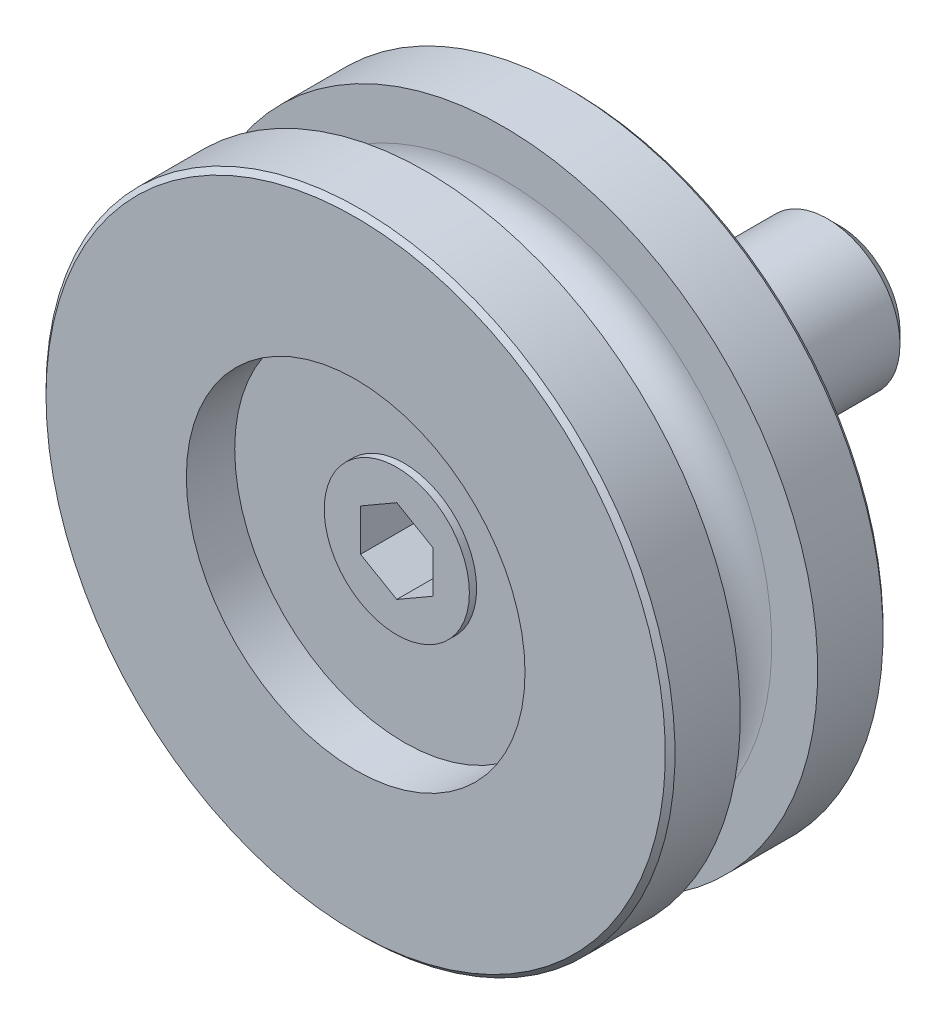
ISO-10303-21;
HEADER;
FILE_DESCRIPTION(('STEP AP214'),'2;1');
FILE_NAME('part.step','',(''),(''),'','','');
FILE_SCHEMA(('AUTOMOTIVE_DESIGN { 1 0 10303 214 1 1 1 1 }'));
ENDSEC;
DATA;
#1=APPLICATION_CONTEXT('core data for automotive mechanical design processes');
#2=APPLICATION_PROTOCOL_DEFINITION('international standard','automotive_design',2000,#1);
#3=PRODUCT_CONTEXT('',#1,'mechanical');
#4=PRODUCT('Part','Part','',(#3));
#5=PRODUCT_RELATED_PRODUCT_CATEGORY('part','',(#4));
#6=PRODUCT_DEFINITION_FORMATION('','',#4);
#7=PRODUCT_DEFINITION_CONTEXT('part definition',#1,'design');
#8=PRODUCT_DEFINITION('design','',#6,#7);
#9=PRODUCT_DEFINITION_SHAPE('','',#8);
#10=(LENGTH_UNIT() NAMED_UNIT(*) SI_UNIT(.MILLI.,.METRE.));
#11=(NAMED_UNIT(*) PLANE_ANGLE_UNIT() SI_UNIT($,.RADIAN.));
#12=(NAMED_UNIT(*) SI_UNIT($,.STERADIAN.) SOLID_ANGLE_UNIT());
#13=UNCERTAINTY_MEASURE_WITH_UNIT(LENGTH_MEASURE(1.E-05),#10,'distance_accuracy_value','');
#14=(GEOMETRIC_REPRESENTATION_CONTEXT(3) GLOBAL_UNCERTAINTY_ASSIGNED_CONTEXT((#13)) GLOBAL_UNIT_ASSIGNED_CONTEXT((#10,
#11,#12)) REPRESENTATION_CONTEXT('',''));
#15=CARTESIAN_POINT('',(0.,0.,0.));
#16=DIRECTION('',(0.,0.,1.));
#17=DIRECTION('',(1.,0.,0.));
#18=AXIS2_PLACEMENT_3D('',#15,#16,#17);
#19=CARTESIAN_POINT('',(0.,-0.5,3.));
#20=DIRECTION('',(0.,0.,1.));
#21=DIRECTION('',(-1.,0.,0.));
#22=AXIS2_PLACEMENT_3D('',#19,#20,#21);
#23=CYLINDRICAL_SURFACE('',#22,6.6);
#24=CARTESIAN_POINT('',(0.,-0.5,2.));
#25=DIRECTION('',(0.,0.,-1.));
#26=DIRECTION('',(0.,-1.,0.));
#27=AXIS2_PLACEMENT_3D('',#24,#25,#26);
#28=CIRCLE('',#27,6.6);
#29=CARTESIAN_POINT('',(-4.44128996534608,-5.38210440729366,2.));
#30=VERTEX_POINT('',#29);
#31=CARTESIAN_POINT('',(4.44128996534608,-5.38210440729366,2.));
#32=VERTEX_POINT('',#31);
#33=EDGE_CURVE('E193',#30,#32,#28,.T.);
#34=ORIENTED_EDGE('',*,*,#33,.T.);
#35=DIRECTION('',(0.,0.,-1.));
#36=VECTOR('',#35,1.);
#37=CARTESIAN_POINT('',(4.44128996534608,-5.38210440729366,3.));
#38=LINE('',#37,#36);
#39=CARTESIAN_POINT('',(4.44128996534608,-5.38210440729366,3.));
#40=VERTEX_POINT('',#39);
#41=EDGE_CURVE('E173',#40,#32,#38,.T.);
#42=ORIENTED_EDGE('',*,*,#41,.F.);
#43=CARTESIAN_POINT('',(0.,-0.5,3.));
#44=DIRECTION('',(0.,0.,-1.));
#45=DIRECTION('',(0.,-1.,0.));
#46=AXIS2_PLACEMENT_3D('',#43,#44,#45);
#47=CIRCLE('',#46,6.6);
#48=CARTESIAN_POINT('',(-4.44128996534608,-5.38210440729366,3.));
#49=VERTEX_POINT('',#48);
#50=EDGE_CURVE('E478',#49,#40,#47,.T.);
#51=ORIENTED_EDGE('',*,*,#50,.F.);
#52=DIRECTION('',(0.,0.,-1.));
#53=VECTOR('',#52,1.);
#54=CARTESIAN_POINT('',(-4.44128996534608,-5.38210440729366,3.));
#55=LINE('',#54,#53);
#56=EDGE_CURVE('E197',#49,#30,#55,.T.);
#57=ORIENTED_EDGE('',*,*,#56,.T.);
#58=EDGE_LOOP('',(#34,#42,#51,#57));
#59=FACE_BOUND('',#58,.T.);
#60=ADVANCED_FACE('F14',(#59),#23,.F.);
#61=CARTESIAN_POINT('',(2.87276702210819,-4.52608403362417,3.));
#62=DIRECTION('',(-0.479051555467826,-0.877786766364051,0.));
#63=DIRECTION('',(-0.877786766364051,0.479051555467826,0.));
#64=AXIS2_PLACEMENT_3D('',#61,#62,#63);
#65=PLANE('',#64);
#66=DIRECTION('',(-0.877786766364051,0.479051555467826,0.));
#67=VECTOR('',#66,1.);
#68=CARTESIAN_POINT('',(2.87276702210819,-4.52608403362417,2.));
#69=LINE('',#68,#67);
#70=CARTESIAN_POINT('',(2.87276702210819,-4.52608403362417,2.));
#71=VERTEX_POINT('',#70);
#72=EDGE_CURVE('E176',#32,#71,#69,.T.);
#73=ORIENTED_EDGE('',*,*,#72,.T.);
#74=DIRECTION('',(0.,0.,-1.));
#75=VECTOR('',#74,1.);
#76=CARTESIAN_POINT('',(2.87276702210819,-4.52608403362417,3.));
#77=LINE('',#76,#75);
#78=CARTESIAN_POINT('',(2.87276702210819,-4.52608403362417,3.));
#79=VERTEX_POINT('',#78);
#80=EDGE_CURVE('E187',#79,#71,#77,.T.);
#81=ORIENTED_EDGE('',*,*,#80,.F.);
#82=DIRECTION('',(-0.877786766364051,0.479051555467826,0.));
#83=VECTOR('',#82,1.);
#84=CARTESIAN_POINT('',(2.87276702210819,-4.52608403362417,3.));
#85=LINE('',#84,#83);
#86=EDGE_CURVE('E201',#40,#79,#85,.T.);
#87=ORIENTED_EDGE('',*,*,#86,.F.);
#88=ORIENTED_EDGE('',*,*,#41,.T.);
#89=EDGE_LOOP('',(#73,#81,#87,#88));
#90=FACE_BOUND('',#89,.T.);
#91=ADVANCED_FACE('F284',(#90),#65,.F.);
#92=CARTESIAN_POINT('',(-0.985268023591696,-5.96796092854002,3.));
#93=DIRECTION('',(-0.97287075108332,0.231349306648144,0.));
#94=DIRECTION('',(0.,0.,1.));
#95=AXIS2_PLACEMENT_3D('',#92,#93,#94);
#96=PLANE('',#95);
#97=DIRECTION('',(0.,0.,-1.));
#98=VECTOR('',#97,1.);
#99=CARTESIAN_POINT('',(-1.40277147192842,-7.72364759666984,-0.5));
#100=LINE('',#99,#98);
#101=CARTESIAN_POINT('',(-1.40277147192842,-7.72364759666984,2.));
#102=VERTEX_POINT('',#101);
#103=CARTESIAN_POINT('',(-1.40277147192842,-7.72364759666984,3.));
#104=VERTEX_POINT('',#103);
#105=EDGE_CURVE('E208',#102,#104,#100,.F.);
#106=ORIENTED_EDGE('',*,*,#105,.F.);
#107=DIRECTION('',(0.231349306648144,0.97287075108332,0.));
#108=VECTOR('',#107,1.);
#109=CARTESIAN_POINT('',(-0.985268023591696,-5.96796092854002,2.));
#110=LINE('',#109,#108);
#111=CARTESIAN_POINT('',(-0.985268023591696,-5.96796092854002,2.));
#112=VERTEX_POINT('',#111);
#113=EDGE_CURVE('E207',#102,#112,#110,.T.);
#114=ORIENTED_EDGE('',*,*,#113,.T.);
#115=DIRECTION('',(0.,0.,-1.));
#116=VECTOR('',#115,1.);
#117=CARTESIAN_POINT('',(-0.985268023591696,-5.96796092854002,3.));
#118=LINE('',#117,#116);
#119=CARTESIAN_POINT('',(-0.985268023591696,-5.96796092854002,3.));
#120=VERTEX_POINT('',#119);
#121=EDGE_CURVE('E167',#120,#112,#118,.T.);
#122=ORIENTED_EDGE('',*,*,#121,.F.);
#123=DIRECTION('',(0.231349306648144,0.97287075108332,0.));
#124=VECTOR('',#123,1.);
#125=CARTESIAN_POINT('',(-0.985268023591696,-5.96796092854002,3.));
#126=LINE('',#125,#124);
#127=EDGE_CURVE('E182',#104,#120,#126,.T.);
#128=ORIENTED_EDGE('',*,*,#127,.F.);
#129=EDGE_LOOP('',(#106,#114,#122,#128));
#130=FACE_BOUND('',#129,.T.);
#131=ADVANCED_FACE('F290',(#130),#96,.F.);
#132=CARTESIAN_POINT('',(-2.87276702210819,-4.52608403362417,3.));
#133=DIRECTION('',(0.479051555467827,-0.87778676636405,0.));
#134=DIRECTION('',(0.,0.,-1.));
#135=AXIS2_PLACEMENT_3D('',#132,#133,#134);
#136=PLANE('',#135);
#137=DIRECTION('',(-0.87778676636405,-0.479051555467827,0.));
#138=VECTOR('',#137,1.);
#139=CARTESIAN_POINT('',(-2.87276702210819,-4.52608403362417,2.));
#140=LINE('',#139,#138);
#141=CARTESIAN_POINT('',(-2.87276702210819,-4.52608403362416,2.));
#142=VERTEX_POINT('',#141);
#143=EDGE_CURVE('E211',#142,#30,#140,.T.);
#144=ORIENTED_EDGE('',*,*,#143,.T.);
#145=ORIENTED_EDGE('',*,*,#56,.F.);
#146=DIRECTION('',(-0.87778676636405,-0.479051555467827,0.));
#147=VECTOR('',#146,1.);
#148=CARTESIAN_POINT('',(-2.87276702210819,-4.52608403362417,3.));
#149=LINE('',#148,#147);
#150=CARTESIAN_POINT('',(-2.87276702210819,-4.52608403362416,3.));
#151=VERTEX_POINT('',#150);
#152=EDGE_CURVE('E177',#151,#49,#149,.T.);
#153=ORIENTED_EDGE('',*,*,#152,.F.);
#154=DIRECTION('',(0.,0.,-1.));
#155=VECTOR('',#154,1.);
#156=CARTESIAN_POINT('',(-2.87276702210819,-4.52608403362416,3.));
#157=LINE('',#156,#155);
#158=EDGE_CURVE('E192',#151,#142,#157,.T.);
#159=ORIENTED_EDGE('',*,*,#158,.T.);
#160=EDGE_LOOP('',(#144,#145,#153,#159));
#161=FACE_BOUND('',#160,.T.);
#162=ADVANCED_FACE('F300',(#161),#136,.F.);
#163=CARTESIAN_POINT('',(0.,-0.5,2.));
#164=DIRECTION('',(0.,0.,-1.));
#165=DIRECTION('',(0.,-1.,0.));
#166=AXIS2_PLACEMENT_3D('',#163,#164,#165);
#167=PLANE('',#166);
#168=CARTESIAN_POINT('',(-2.25,-5.66720682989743,2.));
#169=DIRECTION('',(0.,0.,-1.));
#170=DIRECTION('',(1.,0.,0.));
#171=AXIS2_PLACEMENT_3D('',#168,#169,#170);
#172=CIRCLE('',#171,0.85);
#173=CARTESIAN_POINT('',(-1.4,-5.66720682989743,2.));
#174=VERTEX_POINT('',#173);
#175=EDGE_CURVE('E157',#174,#174,#172,.T.);
#176=ORIENTED_EDGE('',*,*,#175,.F.);
#177=EDGE_LOOP('',(#176));
#178=FACE_BOUND('',#177,.T.);
#179=CARTESIAN_POINT('',(2.25,-5.66720682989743,2.));
#180=DIRECTION('',(0.,0.,1.));
#181=DIRECTION('',(1.,0.,0.));
#182=AXIS2_PLACEMENT_3D('',#179,#180,#181);
#183=CIRCLE('',#182,0.85);
#184=CARTESIAN_POINT('',(3.1,-5.66720682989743,2.));
#185=VERTEX_POINT('',#184);
#186=EDGE_CURVE('E188',#185,#185,#183,.T.);
#187=ORIENTED_EDGE('',*,*,#186,.T.);
#188=EDGE_LOOP('',(#187));
#189=FACE_BOUND('',#188,.T.);
#190=ORIENTED_EDGE('',*,*,#113,.F.);
#191=CARTESIAN_POINT('',(0.,0.,2.));
#192=DIRECTION('',(0.,0.,-1.));
#193=DIRECTION('',(-1.,0.,0.));
#194=AXIS2_PLACEMENT_3D('',#191,#192,#193);
#195=CIRCLE('',#194,7.85);
#196=CARTESIAN_POINT('',(1.40277147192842,-7.72364759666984,2.));
#197=VERTEX_POINT('',#196);
#198=EDGE_CURVE('E9',#102,#197,#195,.T.);
#199=ORIENTED_EDGE('',*,*,#198,.T.);
#200=DIRECTION('',(0.231349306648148,-0.972870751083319,0.));
#201=VECTOR('',#200,1.);
#202=CARTESIAN_POINT('',(0.985268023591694,-5.96796092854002,2.));
#203=LINE('',#202,#201);
#204=CARTESIAN_POINT('',(0.985268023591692,-5.96796092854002,2.));
#205=VERTEX_POINT('',#204);
#206=EDGE_CURVE('E206',#205,#197,#203,.T.);
#207=ORIENTED_EDGE('',*,*,#206,.F.);
#208=CARTESIAN_POINT('',(2.25,-5.66720682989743,2.));
#209=DIRECTION('',(0.,0.,1.));
#210=DIRECTION('',(1.,0.,0.));
#211=AXIS2_PLACEMENT_3D('',#208,#209,#210);
#212=CIRCLE('',#211,1.3);
#213=EDGE_CURVE('E183',#71,#205,#212,.T.);
#214=ORIENTED_EDGE('',*,*,#213,.F.);
#215=ORIENTED_EDGE('',*,*,#72,.F.);
#216=ORIENTED_EDGE('',*,*,#33,.F.);
#217=ORIENTED_EDGE('',*,*,#143,.F.);
#218=CARTESIAN_POINT('',(-2.25,-5.66720682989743,2.));
#219=DIRECTION('',(0.,0.,1.));
#220=DIRECTION('',(-1.,0.,0.));
#221=AXIS2_PLACEMENT_3D('',#218,#219,#220);
#222=CIRCLE('',#221,1.3);
#223=EDGE_CURVE('E465',#112,#142,#222,.T.);
#224=ORIENTED_EDGE('',*,*,#223,.F.);
#225=EDGE_LOOP('',(#190,#199,#207,#214,#215,#216,#217,#224));
#226=FACE_BOUND('',#225,.T.);
#227=ADVANCED_FACE('F303',(#178,#189,#226),#167,.T.);
#228=CARTESIAN_POINT('',(2.25,-5.66720682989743,3.));
#229=DIRECTION('',(0.,0.,1.));
#230=DIRECTION('',(-1.,0.,0.));
#231=AXIS2_PLACEMENT_3D('',#228,#229,#230);
#232=CYLINDRICAL_SURFACE('',#231,0.85);
#233=ORIENTED_EDGE('',*,*,#186,.F.);
#234=EDGE_LOOP('',(#233));
#235=FACE_BOUND('',#234,.T.);
#236=CARTESIAN_POINT('',(2.25,-5.66720682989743,3.));
#237=DIRECTION('',(0.,0.,1.));
#238=DIRECTION('',(1.,0.,0.));
#239=AXIS2_PLACEMENT_3D('',#236,#237,#238);
#240=CIRCLE('',#239,0.85);
#241=CARTESIAN_POINT('',(3.1,-5.66720682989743,3.));
#242=VERTEX_POINT('',#241);
#243=EDGE_CURVE('E152',#242,#242,#240,.T.);
#244=ORIENTED_EDGE('',*,*,#243,.T.);
#245=EDGE_LOOP('',(#244));
#246=FACE_BOUND('',#245,.T.);
#247=ADVANCED_FACE('F307',(#235,#246),#232,.F.);
#248=CARTESIAN_POINT('',(-2.25,-5.66720682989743,3.));
#249=DIRECTION('',(0.,0.,1.));
#250=DIRECTION('',(-1.,0.,0.));
#251=AXIS2_PLACEMENT_3D('',#248,#249,#250);
#252=CYLINDRICAL_SURFACE('',#251,0.85);
#253=ORIENTED_EDGE('',*,*,#175,.T.);
#254=EDGE_LOOP('',(#253));
#255=FACE_BOUND('',#254,.T.);
#256=CARTESIAN_POINT('',(-2.25,-5.66720682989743,3.));
#257=DIRECTION('',(0.,0.,-1.));
#258=DIRECTION('',(1.,0.,0.));
#259=AXIS2_PLACEMENT_3D('',#256,#257,#258);
#260=CIRCLE('',#259,0.85);
#261=CARTESIAN_POINT('',(-1.4,-5.66720682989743,3.));
#262=VERTEX_POINT('',#261);
#263=EDGE_CURVE('E171',#262,#262,#260,.T.);
#264=ORIENTED_EDGE('',*,*,#263,.F.);
#265=EDGE_LOOP('',(#264));
#266=FACE_BOUND('',#265,.T.);
#267=ADVANCED_FACE('F312',(#255,#266),#252,.F.);
#268=CARTESIAN_POINT('',(-2.25,-5.66720682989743,3.));
#269=DIRECTION('',(0.,0.,1.));
#270=DIRECTION('',(-1.,0.,0.));
#271=AXIS2_PLACEMENT_3D('',#268,#269,#270);
#272=CYLINDRICAL_SURFACE('',#271,1.3);
#273=ORIENTED_EDGE('',*,*,#223,.T.);
#274=ORIENTED_EDGE('',*,*,#158,.F.);
#275=CARTESIAN_POINT('',(-2.25,-5.66720682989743,3.));
#276=DIRECTION('',(0.,0.,1.));
#277=DIRECTION('',(-1.,0.,0.));
#278=AXIS2_PLACEMENT_3D('',#275,#276,#277);
#279=CIRCLE('',#278,1.3);
#280=EDGE_CURVE('E178',#120,#151,#279,.T.);
#281=ORIENTED_EDGE('',*,*,#280,.F.);
#282=ORIENTED_EDGE('',*,*,#121,.T.);
#283=EDGE_LOOP('',(#273,#274,#281,#282));
#284=FACE_BOUND('',#283,.T.);
#285=ADVANCED_FACE('F298',(#284),#272,.T.);
#286=CARTESIAN_POINT('',(2.25,-5.66720682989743,3.));
#287=DIRECTION('',(0.,0.,1.));
#288=DIRECTION('',(-1.,0.,0.));
#289=AXIS2_PLACEMENT_3D('',#286,#287,#288);
#290=CYLINDRICAL_SURFACE('',#289,1.3);
#291=ORIENTED_EDGE('',*,*,#213,.T.);
#292=DIRECTION('',(0.,0.,-1.));
#293=VECTOR('',#292,1.);
#294=CARTESIAN_POINT('',(0.985268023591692,-5.96796092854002,3.));
#295=LINE('',#294,#293);
#296=CARTESIAN_POINT('',(0.985268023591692,-5.96796092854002,3.));
#297=VERTEX_POINT('',#296);
#298=EDGE_CURVE('E202',#297,#205,#295,.T.);
#299=ORIENTED_EDGE('',*,*,#298,.F.);
#300=CARTESIAN_POINT('',(2.25,-5.66720682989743,3.));
#301=DIRECTION('',(0.,0.,1.));
#302=DIRECTION('',(1.,0.,0.));
#303=AXIS2_PLACEMENT_3D('',#300,#301,#302);
#304=CIRCLE('',#303,1.3);
#305=EDGE_CURVE('E198',#79,#297,#304,.T.);
#306=ORIENTED_EDGE('',*,*,#305,.F.);
#307=ORIENTED_EDGE('',*,*,#80,.T.);
#308=EDGE_LOOP('',(#291,#299,#306,#307));
#309=FACE_BOUND('',#308,.T.);
#310=ADVANCED_FACE('F294',(#309),#290,.T.);
#311=CARTESIAN_POINT('',(0.985268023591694,-5.96796092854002,3.));
#312=DIRECTION('',(0.972870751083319,0.231349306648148,0.));
#313=DIRECTION('',(0.,0.,-1.));
#314=AXIS2_PLACEMENT_3D('',#311,#312,#313);
#315=PLANE('',#314);
#316=DIRECTION('',(0.,0.,-1.));
#317=VECTOR('',#316,1.);
#318=CARTESIAN_POINT('',(1.40277147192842,-7.72364759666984,-0.5));
#319=LINE('',#318,#317);
#320=CARTESIAN_POINT('',(1.40277147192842,-7.72364759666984,3.));
#321=VERTEX_POINT('',#320);
#322=EDGE_CURVE('E18',#321,#197,#319,.T.);
#323=ORIENTED_EDGE('',*,*,#322,.F.);
#324=DIRECTION('',(0.231349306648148,-0.972870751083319,0.));
#325=VECTOR('',#324,1.);
#326=CARTESIAN_POINT('',(0.985268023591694,-5.96796092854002,3.));
#327=LINE('',#326,#325);
#328=EDGE_CURVE('E31',#297,#321,#327,.T.);
#329=ORIENTED_EDGE('',*,*,#328,.F.);
#330=ORIENTED_EDGE('',*,*,#298,.T.);
#331=ORIENTED_EDGE('',*,*,#206,.T.);
#332=EDGE_LOOP('',(#323,#329,#330,#331));
#333=FACE_BOUND('',#332,.T.);
#334=ADVANCED_FACE('F297',(#333),#315,.F.);
#335=CARTESIAN_POINT('',(0.,4.,3.));
#336=DIRECTION('',(0.,0.,1.));
#337=DIRECTION('',(1.,0.,0.));
#338=AXIS2_PLACEMENT_3D('',#335,#336,#337);
#339=PLANE('',#338);
#340=ORIENTED_EDGE('',*,*,#243,.F.);
#341=EDGE_LOOP('',(#340));
#342=FACE_BOUND('',#341,.T.);
#343=ADVANCED_FACE('F324',(#342),#339,.F.);
#344=ORIENTED_EDGE('',*,*,#263,.T.);
#345=EDGE_LOOP('',(#344));
#346=FACE_BOUND('',#345,.T.);
#347=ADVANCED_FACE('F390',(#346),#339,.F.);
#348=CARTESIAN_POINT('',(0.,0.,5.8));
#349=DIRECTION('',(0.,0.,1.));
#350=DIRECTION('',(1.,0.,0.));
#351=AXIS2_PLACEMENT_3D('',#348,#349,#350);
#352=PLANE('',#351);
#353=DIRECTION('',(-0.866025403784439,0.5,0.));
#354=VECTOR('',#353,1.);
#355=CARTESIAN_POINT('',(1.5,0.86602540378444,5.8));
#356=LINE('',#355,#354);
#357=CARTESIAN_POINT('',(1.5,0.86602540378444,5.8));
#358=VERTEX_POINT('',#357);
#359=CARTESIAN_POINT('',(0.,1.73205080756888,5.8));
#360=VERTEX_POINT('',#359);
#361=EDGE_CURVE('E79',#358,#360,#356,.T.);
#362=ORIENTED_EDGE('',*,*,#361,.T.);
#363=DIRECTION('',(-0.866025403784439,-0.5,0.));
#364=VECTOR('',#363,1.);
#365=CARTESIAN_POINT('',(0.,1.73205080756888,5.8));
#366=LINE('',#365,#364);
#367=CARTESIAN_POINT('',(-1.5,0.866025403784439,5.8));
#368=VERTEX_POINT('',#367);
#369=EDGE_CURVE('E249',#360,#368,#366,.T.);
#370=ORIENTED_EDGE('',*,*,#369,.T.);
#371=DIRECTION('',(0.,-1.,0.));
#372=VECTOR('',#371,1.);
#373=CARTESIAN_POINT('',(-1.5,0.866025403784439,5.8));
#374=LINE('',#373,#372);
#375=CARTESIAN_POINT('',(-1.5,-0.866025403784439,5.8));
#376=VERTEX_POINT('',#375);
#377=EDGE_CURVE('E252',#368,#376,#374,.T.);
#378=ORIENTED_EDGE('',*,*,#377,.T.);
#379=DIRECTION('',(0.866025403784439,-0.5,0.));
#380=VECTOR('',#379,1.);
#381=CARTESIAN_POINT('',(-1.5,-0.866025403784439,5.8));
#382=LINE('',#381,#380);
#383=CARTESIAN_POINT('',(0.,-1.73205080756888,5.8));
#384=VERTEX_POINT('',#383);
#385=EDGE_CURVE('E255',#376,#384,#382,.T.);
#386=ORIENTED_EDGE('',*,*,#385,.T.);
#387=DIRECTION('',(0.866025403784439,0.5,0.));
#388=VECTOR('',#387,1.);
#389=CARTESIAN_POINT('',(0.,-1.73205080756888,5.8));
#390=LINE('',#389,#388);
#391=CARTESIAN_POINT('',(1.5,-0.866025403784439,5.8));
#392=VERTEX_POINT('',#391);
#393=EDGE_CURVE('E257',#384,#392,#390,.T.);
#394=ORIENTED_EDGE('',*,*,#393,.T.);
#395=DIRECTION('',(0.,1.,0.));
#396=VECTOR('',#395,1.);
#397=CARTESIAN_POINT('',(1.5,-0.866025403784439,5.8));
#398=LINE('',#397,#396);
#399=EDGE_CURVE('E108',#392,#358,#398,.T.);
#400=ORIENTED_EDGE('',*,*,#399,.T.);
#401=EDGE_LOOP('',(#362,#370,#378,#386,#394,#400));
#402=FACE_BOUND('',#401,.T.);
#403=ADVANCED_FACE('F261',(#402),#352,.T.);
#404=CARTESIAN_POINT('',(-1.5,0.866025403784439,5.8));
#405=DIRECTION('',(-1.,0.,0.));
#406=DIRECTION('',(0.,-1.,0.));
#407=AXIS2_PLACEMENT_3D('',#404,#405,#406);
#408=PLANE('',#407);
#409=DIRECTION('',(0.,-1.,0.));
#410=VECTOR('',#409,1.);
#411=CARTESIAN_POINT('',(-1.5,0.866025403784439,8.3));
#412=LINE('',#411,#410);
#413=CARTESIAN_POINT('',(-1.5,0.866025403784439,8.3));
#414=VERTEX_POINT('',#413);
#415=CARTESIAN_POINT('',(-1.5,-0.866025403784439,8.3));
#416=VERTEX_POINT('',#415);
#417=EDGE_CURVE('E102',#414,#416,#412,.T.);
#418=ORIENTED_EDGE('',*,*,#417,.T.);
#419=DIRECTION('',(0.,0.,1.));
#420=VECTOR('',#419,1.);
#421=CARTESIAN_POINT('',(-1.5,-0.866025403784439,5.8));
#422=LINE('',#421,#420);
#423=EDGE_CURVE('E120',#376,#416,#422,.T.);
#424=ORIENTED_EDGE('',*,*,#423,.F.);
#425=ORIENTED_EDGE('',*,*,#377,.F.);
#426=DIRECTION('',(0.,0.,1.));
#427=VECTOR('',#426,1.);
#428=CARTESIAN_POINT('',(-1.5,0.866025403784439,5.8));
#429=LINE('',#428,#427);
#430=EDGE_CURVE('E122',#368,#414,#429,.T.);
#431=ORIENTED_EDGE('',*,*,#430,.T.);
#432=EDGE_LOOP('',(#418,#424,#425,#431));
#433=FACE_BOUND('',#432,.T.);
#434=ADVANCED_FACE('F267',(#433),#408,.F.);
#435=CARTESIAN_POINT('',(-1.5,-0.866025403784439,5.8));
#436=DIRECTION('',(-0.5,-0.866025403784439,0.));
#437=DIRECTION('',(0.866025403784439,-0.5,0.));
#438=AXIS2_PLACEMENT_3D('',#435,#436,#437);
#439=PLANE('',#438);
#440=DIRECTION('',(0.866025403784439,-0.5,0.));
#441=VECTOR('',#440,1.);
#442=CARTESIAN_POINT('',(-1.5,-0.866025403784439,8.3));
#443=LINE('',#442,#441);
#444=CARTESIAN_POINT('',(0.,-1.73205080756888,8.3));
#445=VERTEX_POINT('',#444);
#446=EDGE_CURVE('E113',#416,#445,#443,.T.);
#447=ORIENTED_EDGE('',*,*,#446,.T.);
#448=DIRECTION('',(0.,0.,1.));
#449=VECTOR('',#448,1.);
#450=CARTESIAN_POINT('',(0.,-1.73205080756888,5.8));
#451=LINE('',#450,#449);
#452=EDGE_CURVE('E118',#384,#445,#451,.T.);
#453=ORIENTED_EDGE('',*,*,#452,.F.);
#454=ORIENTED_EDGE('',*,*,#385,.F.);
#455=ORIENTED_EDGE('',*,*,#423,.T.);
#456=EDGE_LOOP('',(#447,#453,#454,#455));
#457=FACE_BOUND('',#456,.T.);
#458=ADVANCED_FACE('F271',(#457),#439,.F.);
#459=CARTESIAN_POINT('',(0.,-1.73205080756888,5.8));
#460=DIRECTION('',(0.5,-0.866025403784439,0.));
#461=DIRECTION('',(0.866025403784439,0.5,0.));
#462=AXIS2_PLACEMENT_3D('',#459,#460,#461);
#463=PLANE('',#462);
#464=DIRECTION('',(0.866025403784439,0.5,0.));
#465=VECTOR('',#464,1.);
#466=CARTESIAN_POINT('',(0.,-1.73205080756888,8.3));
#467=LINE('',#466,#465);
#468=CARTESIAN_POINT('',(1.5,-0.866025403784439,8.3));
#469=VERTEX_POINT('',#468);
#470=EDGE_CURVE('E92',#445,#469,#467,.T.);
#471=ORIENTED_EDGE('',*,*,#470,.T.);
#472=DIRECTION('',(0.,0.,1.));
#473=VECTOR('',#472,1.);
#474=CARTESIAN_POINT('',(1.5,-0.866025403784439,5.8));
#475=LINE('',#474,#473);
#476=EDGE_CURVE('E84',#392,#469,#475,.T.);
#477=ORIENTED_EDGE('',*,*,#476,.F.);
#478=ORIENTED_EDGE('',*,*,#393,.F.);
#479=ORIENTED_EDGE('',*,*,#452,.T.);
#480=EDGE_LOOP('',(#471,#477,#478,#479));
#481=FACE_BOUND('',#480,.T.);
#482=ADVANCED_FACE('F273',(#481),#463,.F.);
#483=CARTESIAN_POINT('',(1.5,-0.866025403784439,5.8));
#484=DIRECTION('',(1.,0.,0.));
#485=DIRECTION('',(0.,1.,0.));
#486=AXIS2_PLACEMENT_3D('',#483,#484,#485);
#487=PLANE('',#486);
#488=DIRECTION('',(0.,1.,0.));
#489=VECTOR('',#488,1.);
#490=CARTESIAN_POINT('',(1.5,-0.866025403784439,8.3));
#491=LINE('',#490,#489);
#492=CARTESIAN_POINT('',(1.5,0.86602540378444,8.3));
#493=VERTEX_POINT('',#492);
#494=EDGE_CURVE('E87',#469,#493,#491,.T.);
#495=ORIENTED_EDGE('',*,*,#494,.T.);
#496=DIRECTION('',(0.,0.,1.));
#497=VECTOR('',#496,1.);
#498=CARTESIAN_POINT('',(1.5,0.86602540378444,5.8));
#499=LINE('',#498,#497);
#500=EDGE_CURVE('E72',#358,#493,#499,.T.);
#501=ORIENTED_EDGE('',*,*,#500,.F.);
#502=ORIENTED_EDGE('',*,*,#399,.F.);
#503=ORIENTED_EDGE('',*,*,#476,.T.);
#504=EDGE_LOOP('',(#495,#501,#502,#503));
#505=FACE_BOUND('',#504,.T.);
#506=ADVANCED_FACE('F88',(#505),#487,.F.);
#507=CARTESIAN_POINT('',(1.5,0.86602540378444,5.8));
#508=DIRECTION('',(0.5,0.866025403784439,0.));
#509=DIRECTION('',(-0.866025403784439,0.5,0.));
#510=AXIS2_PLACEMENT_3D('',#507,#508,#509);
#511=PLANE('',#510);
#512=DIRECTION('',(-0.866025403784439,0.5,0.));
#513=VECTOR('',#512,1.);
#514=CARTESIAN_POINT('',(1.5,0.86602540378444,8.3));
#515=LINE('',#514,#513);
#516=CARTESIAN_POINT('',(0.,1.73205080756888,8.3));
#517=VERTEX_POINT('',#516);
#518=EDGE_CURVE('E76',#493,#517,#515,.T.);
#519=ORIENTED_EDGE('',*,*,#518,.T.);
#520=DIRECTION('',(0.,0.,1.));
#521=VECTOR('',#520,1.);
#522=CARTESIAN_POINT('',(0.,1.73205080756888,5.8));
#523=LINE('',#522,#521);
#524=EDGE_CURVE('E124',#360,#517,#523,.T.);
#525=ORIENTED_EDGE('',*,*,#524,.F.);
#526=ORIENTED_EDGE('',*,*,#361,.F.);
#527=ORIENTED_EDGE('',*,*,#500,.T.);
#528=EDGE_LOOP('',(#519,#525,#526,#527));
#529=FACE_BOUND('',#528,.T.);
#530=ADVANCED_FACE('F74',(#529),#511,.F.);
#531=CARTESIAN_POINT('',(0.,1.73205080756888,5.8));
#532=DIRECTION('',(-0.5,0.866025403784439,0.));
#533=DIRECTION('',(-0.866025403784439,-0.5,0.));
#534=AXIS2_PLACEMENT_3D('',#531,#532,#533);
#535=PLANE('',#534);
#536=DIRECTION('',(-0.866025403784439,-0.5,0.));
#537=VECTOR('',#536,1.);
#538=CARTESIAN_POINT('',(0.,1.73205080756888,8.3));
#539=LINE('',#538,#537);
#540=EDGE_CURVE('E99',#517,#414,#539,.T.);
#541=ORIENTED_EDGE('',*,*,#540,.T.);
#542=ORIENTED_EDGE('',*,*,#430,.F.);
#543=ORIENTED_EDGE('',*,*,#369,.F.);
#544=ORIENTED_EDGE('',*,*,#524,.T.);
#545=EDGE_LOOP('',(#541,#542,#543,#544));
#546=FACE_BOUND('',#545,.T.);
#547=ADVANCED_FACE('F265',(#546),#535,.F.);
#548=CARTESIAN_POINT('',(0.,3.,8.3));
#549=DIRECTION('',(0.,0.,-1.));
#550=DIRECTION('',(-1.,0.,0.));
#551=AXIS2_PLACEMENT_3D('',#548,#549,#550);
#552=PLANE('',#551);
#553=ORIENTED_EDGE('',*,*,#540,.F.);
#554=ORIENTED_EDGE('',*,*,#518,.F.);
#555=ORIENTED_EDGE('',*,*,#494,.F.);
#556=ORIENTED_EDGE('',*,*,#470,.F.);
#557=ORIENTED_EDGE('',*,*,#446,.F.);
#558=ORIENTED_EDGE('',*,*,#417,.F.);
#559=EDGE_LOOP('',(#553,#554,#555,#556,#557,#558));
#560=FACE_BOUND('',#559,.T.);
#561=CARTESIAN_POINT('',(0.,0.,8.3));
#562=DIRECTION('',(0.,0.,1.));
#563=DIRECTION('',(1.,0.,0.));
#564=AXIS2_PLACEMENT_3D('',#561,#562,#563);
#565=CIRCLE('',#564,3.);
#566=CARTESIAN_POINT('',(3.,0.,8.3));
#567=VERTEX_POINT('',#566);
#568=EDGE_CURVE('E83',#567,#567,#565,.T.);
#569=ORIENTED_EDGE('',*,*,#568,.T.);
#570=EDGE_LOOP('',(#569));
#571=FACE_BOUND('',#570,.T.);
#572=ADVANCED_FACE('F95',(#560,#571),#552,.F.);
#573=CARTESIAN_POINT('',(0.,0.,11.5));
#574=DIRECTION('',(0.,0.,1.));
#575=DIRECTION('',(1.,0.,0.));
#576=AXIS2_PLACEMENT_3D('',#573,#574,#575);
#577=CYLINDRICAL_SURFACE('',#576,3.);
#578=ORIENTED_EDGE('',*,*,#568,.F.);
#579=EDGE_LOOP('',(#578));
#580=FACE_BOUND('',#579,.T.);
#581=CARTESIAN_POINT('',(0.,0.,8.));
#582=DIRECTION('',(0.,0.,1.));
#583=DIRECTION('',(1.,0.,0.));
#584=AXIS2_PLACEMENT_3D('',#581,#582,#583);
#585=CIRCLE('',#584,3.);
#586=CARTESIAN_POINT('',(3.,0.,8.));
#587=VERTEX_POINT('',#586);
#588=EDGE_CURVE('E128',#587,#587,#585,.T.);
#589=ORIENTED_EDGE('',*,*,#588,.T.);
#590=EDGE_LOOP('',(#589));
#591=FACE_BOUND('',#590,.T.);
#592=ADVANCED_FACE('F636',(#580,#591),#577,.T.);
#593=CARTESIAN_POINT('',(0.,3.,8.));
#594=DIRECTION('',(0.,0.,-1.));
#595=DIRECTION('',(-1.,0.,0.));
#596=AXIS2_PLACEMENT_3D('',#593,#594,#595);
#597=PLANE('',#596);
#598=ORIENTED_EDGE('',*,*,#588,.F.);
#599=EDGE_LOOP('',(#598));
#600=FACE_BOUND('',#599,.T.);
#601=CARTESIAN_POINT('',(0.,0.,8.));
#602=DIRECTION('',(0.,0.,1.));
#603=DIRECTION('',(1.,0.,0.));
#604=AXIS2_PLACEMENT_3D('',#601,#602,#603);
#605=CIRCLE('',#604,7.);
#606=CARTESIAN_POINT('',(7.,0.,8.));
#607=VERTEX_POINT('',#606);
#608=EDGE_CURVE('E131',#607,#607,#605,.T.);
#609=ORIENTED_EDGE('',*,*,#608,.T.);
#610=EDGE_LOOP('',(#609));
#611=FACE_BOUND('',#610,.T.);
#612=ADVANCED_FACE('F645',(#600,#611),#597,.F.);
#613=CARTESIAN_POINT('',(0.,0.,11.5));
#614=DIRECTION('',(0.,0.,1.));
#615=DIRECTION('',(1.,0.,0.));
#616=AXIS2_PLACEMENT_3D('',#613,#614,#615);
#617=CYLINDRICAL_SURFACE('',#616,7.);
#618=ORIENTED_EDGE('',*,*,#608,.F.);
#619=EDGE_LOOP('',(#618));
#620=FACE_BOUND('',#619,.T.);
#621=CARTESIAN_POINT('',(0.,0.,10.));
#622=DIRECTION('',(0.,0.,-1.));
#623=DIRECTION('',(-1.,0.,0.));
#624=AXIS2_PLACEMENT_3D('',#621,#622,#623);
#625=CIRCLE('',#624,7.);
#626=CARTESIAN_POINT('',(-7.,0.,10.));
#627=VERTEX_POINT('',#626);
#628=EDGE_CURVE('E100',#627,#627,#625,.T.);
#629=ORIENTED_EDGE('',*,*,#628,.F.);
#630=EDGE_LOOP('',(#629));
#631=FACE_BOUND('',#630,.T.);
#632=ADVANCED_FACE('F387',(#620,#631),#617,.F.);
#633=CARTESIAN_POINT('',(0.,7.,10.));
#634=DIRECTION('',(0.,0.,1.));
#635=DIRECTION('',(1.,0.,0.));
#636=AXIS2_PLACEMENT_3D('',#633,#634,#635);
#637=PLANE('',#636);
#638=ORIENTED_EDGE('',*,*,#628,.T.);
#639=EDGE_LOOP('',(#638));
#640=FACE_BOUND('',#639,.T.);
#641=CARTESIAN_POINT('',(0.,0.,10.));
#642=DIRECTION('',(0.,0.,-1.));
#643=DIRECTION('',(-1.,0.,0.));
#644=AXIS2_PLACEMENT_3D('',#641,#642,#643);
#645=CIRCLE('',#644,12.8);
#646=CARTESIAN_POINT('',(-12.8,0.,10.));
#647=VERTEX_POINT('',#646);
#648=EDGE_CURVE('E141',#647,#647,#645,.T.);
#649=ORIENTED_EDGE('',*,*,#648,.F.);
#650=EDGE_LOOP('',(#649));
#651=FACE_BOUND('',#650,.T.);
#652=ADVANCED_FACE('F359',(#640,#651),#637,.T.);
#653=CARTESIAN_POINT('',(0.,0.,9.8));
#654=DIRECTION('',(0.,0.,-1.));
#655=DIRECTION('',(-1.,0.,0.));
#656=AXIS2_PLACEMENT_3D('',#653,#654,#655);
#657=CONICAL_SURFACE('',#656,13.,0.785398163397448);
#658=ORIENTED_EDGE('',*,*,#648,.T.);
#659=EDGE_LOOP('',(#658));
#660=FACE_BOUND('',#659,.T.);
#661=CARTESIAN_POINT('',(0.,0.,9.8));
#662=DIRECTION('',(0.,0.,-1.));
#663=DIRECTION('',(-1.,0.,0.));
#664=AXIS2_PLACEMENT_3D('',#661,#662,#663);
#665=CIRCLE('',#664,13.);
#666=CARTESIAN_POINT('',(-13.,0.,9.8));
#667=VERTEX_POINT('',#666);
#668=EDGE_CURVE('E228',#667,#667,#665,.T.);
#669=ORIENTED_EDGE('',*,*,#668,.F.);
#670=EDGE_LOOP('',(#669));
#671=FACE_BOUND('',#670,.T.);
#672=ADVANCED_FACE('F355',(#660,#671),#657,.T.);
#673=CARTESIAN_POINT('',(0.,0.,2.5));
#674=DIRECTION('',(0.,0.,-1.));
#675=DIRECTION('',(-1.,0.,0.));
#676=AXIS2_PLACEMENT_3D('',#673,#674,#675);
#677=CYLINDRICAL_SURFACE('',#676,13.);
#678=ORIENTED_EDGE('',*,*,#668,.T.);
#679=EDGE_LOOP('',(#678));
#680=FACE_BOUND('',#679,.T.);
#681=CARTESIAN_POINT('',(0.,0.,7.1));
#682=DIRECTION('',(0.,0.,-1.));
#683=DIRECTION('',(-1.,0.,0.));
#684=AXIS2_PLACEMENT_3D('',#681,#682,#683);
#685=CIRCLE('',#684,13.);
#686=CARTESIAN_POINT('',(-13.,0.,7.1));
#687=VERTEX_POINT('',#686);
#688=EDGE_CURVE('E231',#687,#687,#685,.T.);
#689=ORIENTED_EDGE('',*,*,#688,.F.);
#690=EDGE_LOOP('',(#689));
#691=FACE_BOUND('',#690,.T.);
#692=ADVANCED_FACE('F358',(#680,#691),#677,.T.);
#693=CARTESIAN_POINT('',(0.,11.1,7.1));
#694=DIRECTION('',(0.,0.,-1.));
#695=DIRECTION('',(-1.,0.,0.));
#696=AXIS2_PLACEMENT_3D('',#693,#694,#695);
#697=PLANE('',#696);
#698=ORIENTED_EDGE('',*,*,#688,.T.);
#699=EDGE_LOOP('',(#698));
#700=FACE_BOUND('',#699,.T.);
#701=CARTESIAN_POINT('',(0.,0.,7.1));
#702=DIRECTION('',(0.,0.,-1.));
#703=DIRECTION('',(-1.,0.,0.));
#704=AXIS2_PLACEMENT_3D('',#701,#702,#703);
#705=CIRCLE('',#704,11.1);
#706=CARTESIAN_POINT('',(-11.1,0.,7.1));
#707=VERTEX_POINT('',#706);
#708=EDGE_CURVE('E234',#707,#707,#705,.T.);
#709=ORIENTED_EDGE('',*,*,#708,.F.);
#710=EDGE_LOOP('',(#709));
#711=FACE_BOUND('',#710,.T.);
#712=ADVANCED_FACE('F363',(#700,#711),#697,.T.);
#713=CARTESIAN_POINT('',(0.,0.,5.5));
#714=DIRECTION('',(0.,0.,-1.));
#715=DIRECTION('',(-1.,0.,0.));
#716=AXIS2_PLACEMENT_3D('',#713,#714,#715);
#717=TOROIDAL_SURFACE('',#716,11.1,1.6);
#718=ORIENTED_EDGE('',*,*,#708,.T.);
#719=EDGE_LOOP('',(#718));
#720=FACE_BOUND('',#719,.T.);
#721=CARTESIAN_POINT('',(0.,0.,3.9));
#722=DIRECTION('',(0.,0.,-1.));
#723=DIRECTION('',(-1.,0.,0.));
#724=AXIS2_PLACEMENT_3D('',#721,#722,#723);
#725=CIRCLE('',#724,11.1);
#726=CARTESIAN_POINT('',(-11.1,0.,3.9));
#727=VERTEX_POINT('',#726);
#728=EDGE_CURVE('E237',#727,#727,#725,.T.);
#729=ORIENTED_EDGE('',*,*,#728,.F.);
#730=EDGE_LOOP('',(#729));
#731=FACE_BOUND('',#730,.T.);
#732=ADVANCED_FACE('F330',(#720,#731),#717,.F.);
#733=CARTESIAN_POINT('',(0.,0.,-10.));
#734=DIRECTION('',(0.,0.,1.));
#735=DIRECTION('',(1.,0.,0.));
#736=AXIS2_PLACEMENT_3D('',#733,#734,#735);
#737=PLANE('',#736);
#738=CARTESIAN_POINT('',(0.,0.,-10.));
#739=DIRECTION('',(0.,0.,1.));
#740=DIRECTION('',(1.,0.,0.));
#741=AXIS2_PLACEMENT_3D('',#738,#739,#740);
#742=CIRCLE('',#741,2.5);
#743=CARTESIAN_POINT('',(2.5,0.,-10.));
#744=VERTEX_POINT('',#743);
#745=EDGE_CURVE('E150',#744,#744,#742,.F.);
#746=ORIENTED_EDGE('',*,*,#745,.T.);
#747=EDGE_LOOP('',(#746));
#748=FACE_BOUND('',#747,.T.);
#749=ADVANCED_FACE('F326',(#748),#737,.F.);
#750=CARTESIAN_POINT('',(0.,11.1,3.9));
#751=DIRECTION('',(0.,0.,1.));
#752=DIRECTION('',(1.,0.,0.));
#753=AXIS2_PLACEMENT_3D('',#750,#751,#752);
#754=PLANE('',#753);
#755=ORIENTED_EDGE('',*,*,#728,.T.);
#756=EDGE_LOOP('',(#755));
#757=FACE_BOUND('',#756,.T.);
#758=CARTESIAN_POINT('',(0.,0.,3.9));
#759=DIRECTION('',(0.,0.,-1.));
#760=DIRECTION('',(-1.,0.,0.));
#761=AXIS2_PLACEMENT_3D('',#758,#759,#760);
#762=CIRCLE('',#761,13.);
#763=CARTESIAN_POINT('',(-13.,0.,3.9));
#764=VERTEX_POINT('',#763);
#765=EDGE_CURVE('E240',#764,#764,#762,.T.);
#766=ORIENTED_EDGE('',*,*,#765,.F.);
#767=EDGE_LOOP('',(#766));
#768=FACE_BOUND('',#767,.T.);
#769=ADVANCED_FACE('F329',(#757,#768),#754,.T.);
#770=CARTESIAN_POINT('',(0.,0.,-9.5));
#771=DIRECTION('',(0.,0.,1.));
#772=DIRECTION('',(1.,0.,0.));
#773=AXIS2_PLACEMENT_3D('',#770,#771,#772);
#774=CONICAL_SURFACE('',#773,3.,0.785398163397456);
#775=ORIENTED_EDGE('',*,*,#745,.F.);
#776=EDGE_LOOP('',(#775));
#777=FACE_BOUND('',#776,.T.);
#778=CARTESIAN_POINT('',(0.,0.,-9.5));
#779=DIRECTION('',(0.,0.,1.));
#780=DIRECTION('',(1.,0.,0.));
#781=AXIS2_PLACEMENT_3D('',#778,#779,#780);
#782=CIRCLE('',#781,3.);
#783=CARTESIAN_POINT('',(3.,0.,-9.5));
#784=VERTEX_POINT('',#783);
#785=EDGE_CURVE('E137',#784,#784,#782,.T.);
#786=ORIENTED_EDGE('',*,*,#785,.F.);
#787=EDGE_LOOP('',(#786));
#788=FACE_BOUND('',#787,.T.);
#789=ADVANCED_FACE('F16',(#777,#788),#774,.T.);
#790=CARTESIAN_POINT('',(0.,0.,2.5));
#791=DIRECTION('',(0.,0.,-1.));
#792=DIRECTION('',(-1.,0.,0.));
#793=AXIS2_PLACEMENT_3D('',#790,#791,#792);
#794=CYLINDRICAL_SURFACE('',#793,13.);
#795=ORIENTED_EDGE('',*,*,#765,.T.);
#796=EDGE_LOOP('',(#795));
#797=FACE_BOUND('',#796,.T.);
#798=CARTESIAN_POINT('',(0.,0.,1.2));
#799=DIRECTION('',(0.,0.,-1.));
#800=DIRECTION('',(-1.,0.,0.));
#801=AXIS2_PLACEMENT_3D('',#798,#799,#800);
#802=CIRCLE('',#801,13.);
#803=CARTESIAN_POINT('',(-13.,0.,1.2));
#804=VERTEX_POINT('',#803);
#805=EDGE_CURVE('E243',#804,#804,#802,.T.);
#806=ORIENTED_EDGE('',*,*,#805,.F.);
#807=EDGE_LOOP('',(#806));
#808=FACE_BOUND('',#807,.T.);
#809=ADVANCED_FACE('F374',(#797,#808),#794,.T.);
#810=CARTESIAN_POINT('',(0.,0.,11.5));
#811=DIRECTION('',(0.,0.,1.));
#812=DIRECTION('',(1.,0.,0.));
#813=AXIS2_PLACEMENT_3D('',#810,#811,#812);
#814=CYLINDRICAL_SURFACE('',#813,3.);
#815=ORIENTED_EDGE('',*,*,#785,.T.);
#816=EDGE_LOOP('',(#815));
#817=FACE_BOUND('',#816,.T.);
#818=CARTESIAN_POINT('',(0.,0.,-2.));
#819=DIRECTION('',(0.,0.,1.));
#820=DIRECTION('',(1.,0.,0.));
#821=AXIS2_PLACEMENT_3D('',#818,#819,#820);
#822=CIRCLE('',#821,3.);
#823=CARTESIAN_POINT('',(3.,0.,-2.));
#824=VERTEX_POINT('',#823);
#825=EDGE_CURVE('E215',#824,#824,#822,.T.);
#826=ORIENTED_EDGE('',*,*,#825,.F.);
#827=EDGE_LOOP('',(#826));
#828=FACE_BOUND('',#827,.T.);
#829=ADVANCED_FACE('F377',(#817,#828),#814,.T.);
#830=CARTESIAN_POINT('',(0.,0.,1.));
#831=DIRECTION('',(0.,0.,1.));
#832=DIRECTION('',(1.,0.,0.));
#833=AXIS2_PLACEMENT_3D('',#830,#831,#832);
#834=CONICAL_SURFACE('',#833,12.8,0.785398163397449);
#835=ORIENTED_EDGE('',*,*,#805,.T.);
#836=EDGE_LOOP('',(#835));
#837=FACE_BOUND('',#836,.T.);
#838=CARTESIAN_POINT('',(0.,0.,1.));
#839=DIRECTION('',(0.,0.,-1.));
#840=DIRECTION('',(-1.,0.,0.));
#841=AXIS2_PLACEMENT_3D('',#838,#839,#840);
#842=CIRCLE('',#841,12.8);
#843=CARTESIAN_POINT('',(-12.8,0.,1.));
#844=VERTEX_POINT('',#843);
#845=EDGE_CURVE('E105',#844,#844,#842,.T.);
#846=ORIENTED_EDGE('',*,*,#845,.F.);
#847=EDGE_LOOP('',(#846));
#848=FACE_BOUND('',#847,.T.);
#849=ADVANCED_FACE('F335',(#837,#848),#834,.T.);
#850=CARTESIAN_POINT('',(0.,0.,-2.));
#851=DIRECTION('',(0.,0.,1.));
#852=DIRECTION('',(1.,0.,0.));
#853=AXIS2_PLACEMENT_3D('',#850,#851,#852);
#854=PLANE('',#853);
#855=CARTESIAN_POINT('',(0.,0.,-2.));
#856=DIRECTION('',(0.,0.,1.));
#857=DIRECTION('',(1.,0.,0.));
#858=AXIS2_PLACEMENT_3D('',#855,#856,#857);
#859=CIRCLE('',#858,2.35);
#860=CARTESIAN_POINT('',(2.35,0.,-2.));
#861=VERTEX_POINT('',#860);
#862=EDGE_CURVE('E212',#861,#861,#859,.T.);
#863=ORIENTED_EDGE('',*,*,#862,.F.);
#864=EDGE_LOOP('',(#863));
#865=FACE_BOUND('',#864,.T.);
#866=ORIENTED_EDGE('',*,*,#825,.T.);
#867=EDGE_LOOP('',(#866));
#868=FACE_BOUND('',#867,.T.);
#869=ADVANCED_FACE('F331',(#865,#868),#854,.T.);
#870=CARTESIAN_POINT('',(0.,7.,1.));
#871=DIRECTION('',(0.,0.,-1.));
#872=DIRECTION('',(-1.,0.,0.));
#873=AXIS2_PLACEMENT_3D('',#870,#871,#872);
#874=PLANE('',#873);
#875=CARTESIAN_POINT('',(0.,0.,1.));
#876=DIRECTION('',(0.,0.,-1.));
#877=DIRECTION('',(-1.,0.,0.));
#878=AXIS2_PLACEMENT_3D('',#875,#876,#877);
#879=CIRCLE('',#878,7.5);
#880=CARTESIAN_POINT('',(-7.5,0.,1.));
#881=VERTEX_POINT('',#880);
#882=EDGE_CURVE('E138',#881,#881,#879,.T.);
#883=ORIENTED_EDGE('',*,*,#882,.F.);
#884=EDGE_LOOP('',(#883));
#885=FACE_BOUND('',#884,.T.);
#886=ORIENTED_EDGE('',*,*,#845,.T.);
#887=EDGE_LOOP('',(#886));
#888=FACE_BOUND('',#887,.T.);
#889=ADVANCED_FACE('F334',(#885,#888),#874,.T.);
#890=CARTESIAN_POINT('',(0.,0.,11.5));
#891=DIRECTION('',(0.,0.,1.));
#892=DIRECTION('',(1.,0.,0.));
#893=AXIS2_PLACEMENT_3D('',#890,#891,#892);
#894=CYLINDRICAL_SURFACE('',#893,2.35);
#895=CARTESIAN_POINT('',(0.,0.,0.));
#896=DIRECTION('',(0.,0.,-1.));
#897=DIRECTION('',(-1.,0.,0.));
#898=AXIS2_PLACEMENT_3D('',#895,#896,#897);
#899=CIRCLE('',#898,2.35);
#900=CARTESIAN_POINT('',(-2.35,0.,0.));
#901=VERTEX_POINT('',#900);
#902=EDGE_CURVE('E143',#901,#901,#899,.T.);
#903=ORIENTED_EDGE('',*,*,#902,.T.);
#904=EDGE_LOOP('',(#903));
#905=FACE_BOUND('',#904,.T.);
#906=ORIENTED_EDGE('',*,*,#862,.T.);
#907=EDGE_LOOP('',(#906));
#908=FACE_BOUND('',#907,.T.);
#909=ADVANCED_FACE('F345',(#905,#908),#894,.T.);
#910=CARTESIAN_POINT('',(0.,0.,-0.5));
#911=DIRECTION('',(0.,0.,-1.));
#912=DIRECTION('',(-1.,0.,0.));
#913=AXIS2_PLACEMENT_3D('',#910,#911,#912);
#914=CYLINDRICAL_SURFACE('',#913,7.5);
#915=ORIENTED_EDGE('',*,*,#882,.T.);
#916=EDGE_LOOP('',(#915));
#917=FACE_BOUND('',#916,.T.);
#918=CARTESIAN_POINT('',(0.,0.,1.85));
#919=DIRECTION('',(0.,0.,-1.));
#920=DIRECTION('',(-1.,0.,0.));
#921=AXIS2_PLACEMENT_3D('',#918,#919,#920);
#922=CIRCLE('',#921,7.5);
#923=CARTESIAN_POINT('',(-7.5,0.,1.85));
#924=VERTEX_POINT('',#923);
#925=EDGE_CURVE('E146',#924,#924,#922,.T.);
#926=ORIENTED_EDGE('',*,*,#925,.F.);
#927=EDGE_LOOP('',(#926));
#928=FACE_BOUND('',#927,.T.);
#929=ADVANCED_FACE('F341',(#917,#928),#914,.F.);
#930=CARTESIAN_POINT('',(0.,0.,0.));
#931=DIRECTION('',(0.,0.,-1.));
#932=DIRECTION('',(-1.,0.,0.));
#933=AXIS2_PLACEMENT_3D('',#930,#931,#932);
#934=PLANE('',#933);
#935=ORIENTED_EDGE('',*,*,#902,.F.);
#936=EDGE_LOOP('',(#935));
#937=FACE_BOUND('',#936,.T.);
#938=CARTESIAN_POINT('',(0.,0.,0.));
#939=DIRECTION('',(0.,0.,-1.));
#940=DIRECTION('',(-1.,0.,0.));
#941=AXIS2_PLACEMENT_3D('',#938,#939,#940);
#942=CIRCLE('',#941,4.);
#943=CARTESIAN_POINT('',(-4.,0.,0.));
#944=VERTEX_POINT('',#943);
#945=EDGE_CURVE('E147',#944,#944,#942,.T.);
#946=ORIENTED_EDGE('',*,*,#945,.T.);
#947=EDGE_LOOP('',(#946));
#948=FACE_BOUND('',#947,.T.);
#949=ADVANCED_FACE('F337',(#937,#948),#934,.T.);
#950=CARTESIAN_POINT('',(0.,7.85,1.85));
#951=DIRECTION('',(0.,0.,-1.));
#952=DIRECTION('',(-1.,0.,0.));
#953=AXIS2_PLACEMENT_3D('',#950,#951,#952);
#954=PLANE('',#953);
#955=CARTESIAN_POINT('',(0.,0.,1.85));
#956=DIRECTION('',(0.,0.,-1.));
#957=DIRECTION('',(-1.,0.,0.));
#958=AXIS2_PLACEMENT_3D('',#955,#956,#957);
#959=CIRCLE('',#958,7.85);
#960=CARTESIAN_POINT('',(-7.85,0.,1.85));
#961=VERTEX_POINT('',#960);
#962=EDGE_CURVE('E222',#961,#961,#959,.T.);
#963=ORIENTED_EDGE('',*,*,#962,.F.);
#964=EDGE_LOOP('',(#963));
#965=FACE_BOUND('',#964,.T.);
#966=ORIENTED_EDGE('',*,*,#925,.T.);
#967=EDGE_LOOP('',(#966));
#968=FACE_BOUND('',#967,.T.);
#969=ADVANCED_FACE('F340',(#965,#968),#954,.F.);
#970=CARTESIAN_POINT('',(0.,0.,-0.5));
#971=DIRECTION('',(0.,0.,-1.));
#972=DIRECTION('',(-1.,0.,0.));
#973=AXIS2_PLACEMENT_3D('',#970,#971,#972);
#974=CYLINDRICAL_SURFACE('',#973,7.85);
#975=ORIENTED_EDGE('',*,*,#962,.T.);
#976=EDGE_LOOP('',(#975));
#977=FACE_BOUND('',#976,.T.);
#978=CARTESIAN_POINT('',(0.,0.,3.));
#979=DIRECTION('',(0.,0.,-1.));
#980=DIRECTION('',(-1.,0.,0.));
#981=AXIS2_PLACEMENT_3D('',#978,#979,#980);
#982=CIRCLE('',#981,7.85);
#983=EDGE_CURVE('E142',#321,#104,#982,.T.);
#984=ORIENTED_EDGE('',*,*,#983,.F.);
#985=ORIENTED_EDGE('',*,*,#322,.T.);
#986=ORIENTED_EDGE('',*,*,#198,.F.);
#987=ORIENTED_EDGE('',*,*,#105,.T.);
#988=EDGE_LOOP('',(#984,#985,#986,#987));
#989=FACE_BOUND('',#988,.T.);
#990=ADVANCED_FACE('F349',(#977,#989),#974,.F.);
#991=CARTESIAN_POINT('',(0.,0.,11.5));
#992=DIRECTION('',(0.,0.,1.));
#993=DIRECTION('',(1.,0.,0.));
#994=AXIS2_PLACEMENT_3D('',#991,#992,#993);
#995=CYLINDRICAL_SURFACE('',#994,4.);
#996=CARTESIAN_POINT('',(0.,0.,3.));
#997=DIRECTION('',(0.,0.,1.));
#998=DIRECTION('',(1.,0.,0.));
#999=AXIS2_PLACEMENT_3D('',#996,#997,#998);
#1000=CIRCLE('',#999,4.);
#1001=CARTESIAN_POINT('',(4.,0.,3.));
#1002=VERTEX_POINT('',#1001);
#1003=EDGE_CURVE('E134',#1002,#1002,#1000,.T.);
#1004=ORIENTED_EDGE('',*,*,#1003,.F.);
#1005=EDGE_LOOP('',(#1004));
#1006=FACE_BOUND('',#1005,.T.);
#1007=ORIENTED_EDGE('',*,*,#945,.F.);
#1008=EDGE_LOOP('',(#1007));
#1009=FACE_BOUND('',#1008,.T.);
#1010=ADVANCED_FACE('F353',(#1006,#1009),#995,.T.);
#1011=ORIENTED_EDGE('',*,*,#1003,.T.);
#1012=EDGE_LOOP('',(#1011));
#1013=FACE_BOUND('',#1012,.T.);
#1014=ORIENTED_EDGE('',*,*,#305,.T.);
#1015=ORIENTED_EDGE('',*,*,#328,.T.);
#1016=ORIENTED_EDGE('',*,*,#983,.T.);
#1017=ORIENTED_EDGE('',*,*,#127,.T.);
#1018=ORIENTED_EDGE('',*,*,#280,.T.);
#1019=ORIENTED_EDGE('',*,*,#152,.T.);
#1020=ORIENTED_EDGE('',*,*,#50,.T.);
#1021=ORIENTED_EDGE('',*,*,#86,.T.);
#1022=EDGE_LOOP('',(#1014,#1015,#1016,#1017,#1018,#1019,#1020,#1021));
#1023=FACE_BOUND('',#1022,.T.);
#1024=ADVANCED_FACE('F398',(#1013,#1023),#339,.F.);
#1025=CLOSED_SHELL('',(#60,#91,#131,#162,#227,#247,#267,#285,#310,#334,#343,#347,#403,#434,#458,
#482,#506,#530,#547,#572,#592,#612,#632,#652,#672,#692,#712,#732,#749,#769,#789,#809,#829,#849,
#869,#889,#909,#929,#949,#969,#990,#1010,#1024));
#1026=MANIFOLD_SOLID_BREP('B1',#1025);
#1027=ADVANCED_BREP_SHAPE_REPRESENTATION('',(#18,#1026),#14);
#1028=SHAPE_DEFINITION_REPRESENTATION(#9,#1027);
ENDSEC;
END-ISO-10303-21;
